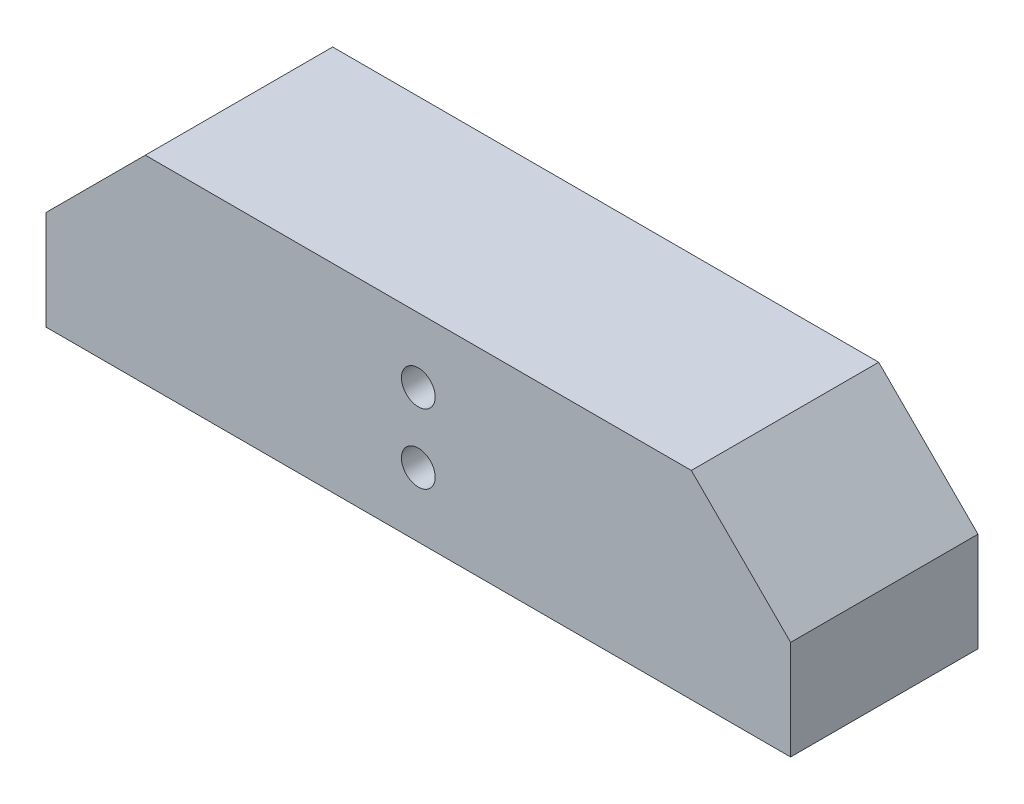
ISO-10303-21;
HEADER;
FILE_DESCRIPTION(('STEP AP214'),'2;1');
FILE_NAME('part.step','',(''),(''),'','','');
FILE_SCHEMA(('AUTOMOTIVE_DESIGN { 1 0 10303 214 1 1 1 1 }'));
ENDSEC;
DATA;
#1=APPLICATION_CONTEXT('core data for automotive mechanical design processes');
#2=APPLICATION_PROTOCOL_DEFINITION('international standard','automotive_design',2000,#1);
#3=PRODUCT_CONTEXT('',#1,'mechanical');
#4=PRODUCT('Part','Part','',(#3));
#5=PRODUCT_RELATED_PRODUCT_CATEGORY('part','',(#4));
#6=PRODUCT_DEFINITION_FORMATION('','',#4);
#7=PRODUCT_DEFINITION_CONTEXT('part definition',#1,'design');
#8=PRODUCT_DEFINITION('design','',#6,#7);
#9=PRODUCT_DEFINITION_SHAPE('','',#8);
#10=(LENGTH_UNIT() NAMED_UNIT(*) SI_UNIT(.MILLI.,.METRE.));
#11=(NAMED_UNIT(*) PLANE_ANGLE_UNIT() SI_UNIT($,.RADIAN.));
#12=(NAMED_UNIT(*) SI_UNIT($,.STERADIAN.) SOLID_ANGLE_UNIT());
#13=UNCERTAINTY_MEASURE_WITH_UNIT(LENGTH_MEASURE(1.E-05),#10,'distance_accuracy_value','');
#14=(GEOMETRIC_REPRESENTATION_CONTEXT(3) GLOBAL_UNCERTAINTY_ASSIGNED_CONTEXT((#13)) GLOBAL_UNIT_ASSIGNED_CONTEXT((#10,
#11,#12)) REPRESENTATION_CONTEXT('',''));
#15=CARTESIAN_POINT('',(0.,0.,0.));
#16=DIRECTION('',(0.,0.,1.));
#17=DIRECTION('',(1.,0.,0.));
#18=AXIS2_PLACEMENT_3D('',#15,#16,#17);
#19=CARTESIAN_POINT('',(75.,-20.,10.));
#20=DIRECTION('',(-1.,0.,0.));
#21=DIRECTION('',(0.,0.,1.));
#22=AXIS2_PLACEMENT_3D('',#19,#20,#21);
#23=PLANE('',#22);
#24=DIRECTION('',(0.,1.,0.));
#25=VECTOR('',#24,1.);
#26=CARTESIAN_POINT('',(75.,-20.,0.));
#27=LINE('',#26,#25);
#28=CARTESIAN_POINT('',(75.,-20.,0.));
#29=VERTEX_POINT('',#28);
#30=CARTESIAN_POINT('',(75.,0.,0.));
#31=VERTEX_POINT('',#30);
#32=EDGE_CURVE('E172',#29,#31,#27,.T.);
#33=ORIENTED_EDGE('',*,*,#32,.T.);
#34=DIRECTION('',(0.,0.,1.));
#35=VECTOR('',#34,1.);
#36=CARTESIAN_POINT('',(75.,0.,10.));
#37=LINE('',#36,#35);
#38=CARTESIAN_POINT('',(75.,0.,37.75));
#39=VERTEX_POINT('',#38);
#40=EDGE_CURVE('E56',#31,#39,#37,.T.);
#41=ORIENTED_EDGE('',*,*,#40,.T.);
#42=DIRECTION('',(0.,1.,0.));
#43=VECTOR('',#42,1.);
#44=CARTESIAN_POINT('',(75.,20.,37.75));
#45=LINE('',#44,#43);
#46=CARTESIAN_POINT('',(75.,-20.,37.75));
#47=VERTEX_POINT('',#46);
#48=EDGE_CURVE('E157',#47,#39,#45,.T.);
#49=ORIENTED_EDGE('',*,*,#48,.F.);
#50=DIRECTION('',(0.,0.,-1.));
#51=VECTOR('',#50,1.);
#52=CARTESIAN_POINT('',(75.,-20.,10.));
#53=LINE('',#52,#51);
#54=EDGE_CURVE('E153',#47,#29,#53,.T.);
#55=ORIENTED_EDGE('',*,*,#54,.T.);
#56=EDGE_LOOP('',(#33,#41,#49,#55));
#57=FACE_BOUND('',#56,.T.);
#58=ADVANCED_FACE('F33',(#57),#23,.F.);
#59=CARTESIAN_POINT('',(-75.,20.,10.));
#60=DIRECTION('',(0.,-1.,0.));
#61=DIRECTION('',(0.,0.,-1.));
#62=AXIS2_PLACEMENT_3D('',#59,#60,#61);
#63=PLANE('',#62);
#64=DIRECTION('',(-1.,0.,0.));
#65=VECTOR('',#64,1.);
#66=CARTESIAN_POINT('',(-75.,20.,37.75));
#67=LINE('',#66,#65);
#68=CARTESIAN_POINT('',(55.,20.,37.75));
#69=VERTEX_POINT('',#68);
#70=CARTESIAN_POINT('',(-54.9999999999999,20.,37.75));
#71=VERTEX_POINT('',#70);
#72=EDGE_CURVE('E159',#69,#71,#67,.T.);
#73=ORIENTED_EDGE('',*,*,#72,.F.);
#74=DIRECTION('',(0.,0.,-1.));
#75=VECTOR('',#74,1.);
#76=CARTESIAN_POINT('',(55.,20.,10.));
#77=LINE('',#76,#75);
#78=CARTESIAN_POINT('',(55.,20.,0.));
#79=VERTEX_POINT('',#78);
#80=EDGE_CURVE('E259',#69,#79,#77,.T.);
#81=ORIENTED_EDGE('',*,*,#80,.T.);
#82=DIRECTION('',(-1.,0.,0.));
#83=VECTOR('',#82,1.);
#84=CARTESIAN_POINT('',(-75.,20.,0.));
#85=LINE('',#84,#83);
#86=CARTESIAN_POINT('',(-54.9999999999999,20.,0.));
#87=VERTEX_POINT('',#86);
#88=EDGE_CURVE('E201',#79,#87,#85,.T.);
#89=ORIENTED_EDGE('',*,*,#88,.T.);
#90=DIRECTION('',(0.,0.,1.));
#91=VECTOR('',#90,1.);
#92=CARTESIAN_POINT('',(-54.9999999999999,20.,10.));
#93=LINE('',#92,#91);
#94=EDGE_CURVE('E257',#87,#71,#93,.T.);
#95=ORIENTED_EDGE('',*,*,#94,.T.);
#96=EDGE_LOOP('',(#73,#81,#89,#95));
#97=FACE_BOUND('',#96,.T.);
#98=ADVANCED_FACE('F272',(#97),#63,.F.);
#99=CARTESIAN_POINT('',(-75.,-20.,10.));
#100=DIRECTION('',(1.,0.,0.));
#101=DIRECTION('',(0.,0.,-1.));
#102=AXIS2_PLACEMENT_3D('',#99,#100,#101);
#103=PLANE('',#102);
#104=DIRECTION('',(0.,-1.,0.));
#105=VECTOR('',#104,1.);
#106=CARTESIAN_POINT('',(-75.,20.,37.75));
#107=LINE('',#106,#105);
#108=CARTESIAN_POINT('',(-75.,0.,37.75));
#109=VERTEX_POINT('',#108);
#110=CARTESIAN_POINT('',(-75.,-20.,37.75));
#111=VERTEX_POINT('',#110);
#112=EDGE_CURVE('E135',#109,#111,#107,.T.);
#113=ORIENTED_EDGE('',*,*,#112,.F.);
#114=DIRECTION('',(0.,0.,-1.));
#115=VECTOR('',#114,1.);
#116=CARTESIAN_POINT('',(-75.,0.,10.));
#117=LINE('',#116,#115);
#118=CARTESIAN_POINT('',(-75.,0.,0.));
#119=VERTEX_POINT('',#118);
#120=EDGE_CURVE('E11',#109,#119,#117,.T.);
#121=ORIENTED_EDGE('',*,*,#120,.T.);
#122=DIRECTION('',(0.,-1.,0.));
#123=VECTOR('',#122,1.);
#124=CARTESIAN_POINT('',(-75.,-20.,0.));
#125=LINE('',#124,#123);
#126=CARTESIAN_POINT('',(-75.,-20.,0.));
#127=VERTEX_POINT('',#126);
#128=EDGE_CURVE('E148',#119,#127,#125,.T.);
#129=ORIENTED_EDGE('',*,*,#128,.T.);
#130=DIRECTION('',(0.,0.,-1.));
#131=VECTOR('',#130,1.);
#132=CARTESIAN_POINT('',(-75.,-20.,10.));
#133=LINE('',#132,#131);
#134=EDGE_CURVE('E145',#111,#127,#133,.T.);
#135=ORIENTED_EDGE('',*,*,#134,.F.);
#136=EDGE_LOOP('',(#113,#121,#129,#135));
#137=FACE_BOUND('',#136,.T.);
#138=ADVANCED_FACE('F146',(#137),#103,.F.);
#139=CARTESIAN_POINT('',(-45.,-13.,10.));
#140=DIRECTION('',(0.,0.,-1.));
#141=DIRECTION('',(-1.,0.,0.));
#142=AXIS2_PLACEMENT_3D('',#139,#140,#141);
#143=CYLINDRICAL_SURFACE('',#142,15.);
#144=CARTESIAN_POINT('',(-45.,-13.,0.));
#145=DIRECTION('',(0.,0.,-1.));
#146=DIRECTION('',(1.,0.,0.));
#147=AXIS2_PLACEMENT_3D('',#144,#145,#146);
#148=CIRCLE('',#147,15.);
#149=CARTESIAN_POINT('',(-59.3365383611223,-17.4117647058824,0.));
#150=VERTEX_POINT('',#149);
#151=CARTESIAN_POINT('',(-30.6634616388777,-17.4117647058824,0.));
#152=VERTEX_POINT('',#151);
#153=EDGE_CURVE('E207',#150,#152,#148,.T.);
#154=ORIENTED_EDGE('',*,*,#153,.T.);
#155=DIRECTION('',(0.,0.,-1.));
#156=VECTOR('',#155,1.);
#157=CARTESIAN_POINT('',(-30.6634616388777,-17.4117647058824,10.));
#158=LINE('',#157,#156);
#159=CARTESIAN_POINT('',(-30.6634616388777,-17.4117647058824,10.));
#160=VERTEX_POINT('',#159);
#161=EDGE_CURVE('E253',#152,#160,#158,.F.);
#162=ORIENTED_EDGE('',*,*,#161,.T.);
#163=CARTESIAN_POINT('',(-45.,-13.,10.));
#164=DIRECTION('',(0.,0.,-1.));
#165=DIRECTION('',(1.,0.,0.));
#166=AXIS2_PLACEMENT_3D('',#163,#164,#165);
#167=CIRCLE('',#166,15.);
#168=CARTESIAN_POINT('',(-59.3365383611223,-17.4117647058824,10.));
#169=VERTEX_POINT('',#168);
#170=EDGE_CURVE('E193',#169,#160,#167,.T.);
#171=ORIENTED_EDGE('',*,*,#170,.F.);
#172=DIRECTION('',(0.,0.,-1.));
#173=VECTOR('',#172,1.);
#174=CARTESIAN_POINT('',(-59.3365383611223,-17.4117647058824,10.));
#175=LINE('',#174,#173);
#176=EDGE_CURVE('E250',#169,#150,#175,.T.);
#177=ORIENTED_EDGE('',*,*,#176,.T.);
#178=EDGE_LOOP('',(#154,#162,#171,#177));
#179=FACE_BOUND('',#178,.T.);
#180=ADVANCED_FACE('F357',(#179),#143,.F.);
#181=CARTESIAN_POINT('',(45.,-13.,10.));
#182=DIRECTION('',(0.,0.,-1.));
#183=DIRECTION('',(-1.,0.,0.));
#184=AXIS2_PLACEMENT_3D('',#181,#182,#183);
#185=CYLINDRICAL_SURFACE('',#184,15.);
#186=CARTESIAN_POINT('',(45.,-13.,10.));
#187=DIRECTION('',(0.,0.,-1.));
#188=DIRECTION('',(1.,0.,0.));
#189=AXIS2_PLACEMENT_3D('',#186,#187,#188);
#190=CIRCLE('',#189,15.);
#191=CARTESIAN_POINT('',(30.6634616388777,-17.4117647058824,10.));
#192=VERTEX_POINT('',#191);
#193=CARTESIAN_POINT('',(59.3365383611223,-17.4117647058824,10.));
#194=VERTEX_POINT('',#193);
#195=EDGE_CURVE('E196',#192,#194,#190,.T.);
#196=ORIENTED_EDGE('',*,*,#195,.F.);
#197=DIRECTION('',(0.,0.,-1.));
#198=VECTOR('',#197,1.);
#199=CARTESIAN_POINT('',(30.6634616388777,-17.4117647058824,10.));
#200=LINE('',#199,#198);
#201=CARTESIAN_POINT('',(30.6634616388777,-17.4117647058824,0.));
#202=VERTEX_POINT('',#201);
#203=EDGE_CURVE('E219',#192,#202,#200,.T.);
#204=ORIENTED_EDGE('',*,*,#203,.T.);
#205=CARTESIAN_POINT('',(45.,-13.,0.));
#206=DIRECTION('',(0.,0.,-1.));
#207=DIRECTION('',(1.,0.,0.));
#208=AXIS2_PLACEMENT_3D('',#205,#206,#207);
#209=CIRCLE('',#208,15.);
#210=CARTESIAN_POINT('',(59.3365383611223,-17.4117647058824,0.));
#211=VERTEX_POINT('',#210);
#212=EDGE_CURVE('E213',#202,#211,#209,.T.);
#213=ORIENTED_EDGE('',*,*,#212,.T.);
#214=DIRECTION('',(0.,0.,-1.));
#215=VECTOR('',#214,1.);
#216=CARTESIAN_POINT('',(59.3365383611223,-17.4117647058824,10.));
#217=LINE('',#216,#215);
#218=EDGE_CURVE('E152',#211,#194,#217,.F.);
#219=ORIENTED_EDGE('',*,*,#218,.T.);
#220=EDGE_LOOP('',(#196,#204,#213,#219));
#221=FACE_BOUND('',#220,.T.);
#222=ADVANCED_FACE('F352',(#221),#185,.F.);
#223=CARTESIAN_POINT('',(58.2664991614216,-20.,10.));
#224=DIRECTION('',(0.,1.,0.));
#225=DIRECTION('',(0.,0.,1.));
#226=AXIS2_PLACEMENT_3D('',#223,#224,#225);
#227=PLANE('',#226);
#228=ORIENTED_EDGE('',*,*,#54,.F.);
#229=DIRECTION('',(1.,0.,0.));
#230=VECTOR('',#229,1.);
#231=CARTESIAN_POINT('',(-75.,-20.,37.75));
#232=LINE('',#231,#230);
#233=EDGE_CURVE('E139',#111,#47,#232,.T.);
#234=ORIENTED_EDGE('',*,*,#233,.F.);
#235=ORIENTED_EDGE('',*,*,#134,.T.);
#236=DIRECTION('',(1.,0.,0.));
#237=VECTOR('',#236,1.);
#238=CARTESIAN_POINT('',(-75.,-20.,0.));
#239=LINE('',#238,#237);
#240=CARTESIAN_POINT('',(-61.2480768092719,-20.,0.));
#241=VERTEX_POINT('',#240);
#242=EDGE_CURVE('E205',#127,#241,#239,.T.);
#243=ORIENTED_EDGE('',*,*,#242,.T.);
#244=DIRECTION('',(0.,0.,-1.));
#245=VECTOR('',#244,1.);
#246=CARTESIAN_POINT('',(-61.2480768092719,-20.,10.));
#247=LINE('',#246,#245);
#248=CARTESIAN_POINT('',(-61.2480768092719,-20.,10.));
#249=VERTEX_POINT('',#248);
#250=EDGE_CURVE('E255',#241,#249,#247,.F.);
#251=ORIENTED_EDGE('',*,*,#250,.T.);
#252=DIRECTION('',(1.,0.,0.));
#253=VECTOR('',#252,1.);
#254=CARTESIAN_POINT('',(-75.,-20.,10.));
#255=LINE('',#254,#253);
#256=CARTESIAN_POINT('',(-28.7519231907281,-20.,10.));
#257=VERTEX_POINT('',#256);
#258=EDGE_CURVE('E142',#249,#257,#255,.T.);
#259=ORIENTED_EDGE('',*,*,#258,.T.);
#260=DIRECTION('',(0.,0.,-1.));
#261=VECTOR('',#260,1.);
#262=CARTESIAN_POINT('',(-28.7519231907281,-20.,10.));
#263=LINE('',#262,#261);
#264=CARTESIAN_POINT('',(-28.7519231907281,-20.,0.));
#265=VERTEX_POINT('',#264);
#266=EDGE_CURVE('E230',#257,#265,#263,.T.);
#267=ORIENTED_EDGE('',*,*,#266,.T.);
#268=DIRECTION('',(1.,0.,0.));
#269=VECTOR('',#268,1.);
#270=CARTESIAN_POINT('',(-31.7335008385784,-20.,0.));
#271=LINE('',#270,#269);
#272=CARTESIAN_POINT('',(28.7519231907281,-20.,0.));
#273=VERTEX_POINT('',#272);
#274=EDGE_CURVE('E210',#265,#273,#271,.T.);
#275=ORIENTED_EDGE('',*,*,#274,.T.);
#276=DIRECTION('',(0.,0.,-1.));
#277=VECTOR('',#276,1.);
#278=CARTESIAN_POINT('',(28.7519231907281,-20.,10.));
#279=LINE('',#278,#277);
#280=CARTESIAN_POINT('',(28.7519231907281,-20.,10.));
#281=VERTEX_POINT('',#280);
#282=EDGE_CURVE('E233',#273,#281,#279,.F.);
#283=ORIENTED_EDGE('',*,*,#282,.T.);
#284=CARTESIAN_POINT('',(61.2480768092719,-20.,10.));
#285=VERTEX_POINT('',#284);
#286=EDGE_CURVE('E165',#281,#285,#255,.T.);
#287=ORIENTED_EDGE('',*,*,#286,.T.);
#288=DIRECTION('',(0.,0.,-1.));
#289=VECTOR('',#288,1.);
#290=CARTESIAN_POINT('',(61.2480768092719,-20.,10.));
#291=LINE('',#290,#289);
#292=CARTESIAN_POINT('',(61.2480768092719,-20.,0.));
#293=VERTEX_POINT('',#292);
#294=EDGE_CURVE('E247',#285,#293,#291,.T.);
#295=ORIENTED_EDGE('',*,*,#294,.T.);
#296=DIRECTION('',(1.,0.,0.));
#297=VECTOR('',#296,1.);
#298=CARTESIAN_POINT('',(58.2664991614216,-20.,0.));
#299=LINE('',#298,#297);
#300=EDGE_CURVE('E197',#293,#29,#299,.T.);
#301=ORIENTED_EDGE('',*,*,#300,.T.);
#302=EDGE_LOOP('',(#228,#234,#235,#243,#251,#259,#267,#275,#283,#287,#295,#301));
#303=FACE_BOUND('',#302,.T.);
#304=ADVANCED_FACE('F155',(#303),#227,.F.);
#305=CARTESIAN_POINT('',(-45.,-13.,0.));
#306=DIRECTION('',(0.,0.,1.));
#307=DIRECTION('',(1.,0.,0.));
#308=AXIS2_PLACEMENT_3D('',#305,#306,#307);
#309=PLANE('',#308);
#310=CARTESIAN_POINT('',(-66.9,-17.,0.));
#311=DIRECTION('',(0.,0.,1.));
#312=DIRECTION('',(1.,0.,0.));
#313=AXIS2_PLACEMENT_3D('',#310,#311,#312);
#314=CIRCLE('',#313,0.999999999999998);
#315=CARTESIAN_POINT('',(-65.9,-17.,0.));
#316=VERTEX_POINT('',#315);
#317=EDGE_CURVE('E169',#316,#316,#314,.T.);
#318=ORIENTED_EDGE('',*,*,#317,.T.);
#319=EDGE_LOOP('',(#318));
#320=FACE_BOUND('',#319,.T.);
#321=CARTESIAN_POINT('',(23.1,-17.,0.));
#322=DIRECTION('',(0.,0.,1.));
#323=DIRECTION('',(1.,0.,0.));
#324=AXIS2_PLACEMENT_3D('',#321,#322,#323);
#325=CIRCLE('',#324,1.);
#326=CARTESIAN_POINT('',(24.1,-17.,0.));
#327=VERTEX_POINT('',#326);
#328=EDGE_CURVE('E173',#327,#327,#325,.T.);
#329=ORIENTED_EDGE('',*,*,#328,.T.);
#330=EDGE_LOOP('',(#329));
#331=FACE_BOUND('',#330,.T.);
#332=CARTESIAN_POINT('',(-23.1,-17.,0.));
#333=DIRECTION('',(0.,0.,1.));
#334=DIRECTION('',(1.,0.,0.));
#335=AXIS2_PLACEMENT_3D('',#332,#333,#334);
#336=CIRCLE('',#335,1.);
#337=CARTESIAN_POINT('',(-22.1,-17.,0.));
#338=VERTEX_POINT('',#337);
#339=EDGE_CURVE('E181',#338,#338,#336,.T.);
#340=ORIENTED_EDGE('',*,*,#339,.T.);
#341=EDGE_LOOP('',(#340));
#342=FACE_BOUND('',#341,.T.);
#343=CARTESIAN_POINT('',(66.9,-17.,0.));
#344=DIRECTION('',(0.,0.,1.));
#345=DIRECTION('',(1.,0.,0.));
#346=AXIS2_PLACEMENT_3D('',#343,#344,#345);
#347=CIRCLE('',#346,0.999999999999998);
#348=CARTESIAN_POINT('',(67.9,-17.,0.));
#349=VERTEX_POINT('',#348);
#350=EDGE_CURVE('E177',#349,#349,#347,.T.);
#351=ORIENTED_EDGE('',*,*,#350,.T.);
#352=EDGE_LOOP('',(#351));
#353=FACE_BOUND('',#352,.T.);
#354=ORIENTED_EDGE('',*,*,#88,.F.);
#355=DIRECTION('',(-0.707106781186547,0.707106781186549,0.));
#356=VECTOR('',#355,1.);
#357=CARTESIAN_POINT('',(55.,20.,0.));
#358=LINE('',#357,#356);
#359=EDGE_CURVE('E264',#79,#31,#358,.F.);
#360=ORIENTED_EDGE('',*,*,#359,.T.);
#361=ORIENTED_EDGE('',*,*,#32,.F.);
#362=ORIENTED_EDGE('',*,*,#300,.F.);
#363=CARTESIAN_POINT('',(61.2480768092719,-18.,0.));
#364=DIRECTION('',(0.,0.,1.));
#365=DIRECTION('',(1.,0.,0.));
#366=AXIS2_PLACEMENT_3D('',#363,#364,#365);
#367=CIRCLE('',#366,2.);
#368=EDGE_CURVE('E226',#293,#211,#367,.F.);
#369=ORIENTED_EDGE('',*,*,#368,.T.);
#370=ORIENTED_EDGE('',*,*,#212,.F.);
#371=CARTESIAN_POINT('',(28.7519231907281,-18.,0.));
#372=DIRECTION('',(0.,0.,1.));
#373=DIRECTION('',(1.,0.,0.));
#374=AXIS2_PLACEMENT_3D('',#371,#372,#373);
#375=CIRCLE('',#374,2.);
#376=EDGE_CURVE('E228',#202,#273,#375,.F.);
#377=ORIENTED_EDGE('',*,*,#376,.T.);
#378=ORIENTED_EDGE('',*,*,#274,.F.);
#379=CARTESIAN_POINT('',(-28.7519231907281,-18.,0.));
#380=DIRECTION('',(0.,0.,1.));
#381=DIRECTION('',(1.,0.,0.));
#382=AXIS2_PLACEMENT_3D('',#379,#380,#381);
#383=CIRCLE('',#382,2.);
#384=EDGE_CURVE('E224',#265,#152,#383,.F.);
#385=ORIENTED_EDGE('',*,*,#384,.T.);
#386=ORIENTED_EDGE('',*,*,#153,.F.);
#387=CARTESIAN_POINT('',(-61.2480768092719,-18.,0.));
#388=DIRECTION('',(0.,0.,1.));
#389=DIRECTION('',(1.,0.,0.));
#390=AXIS2_PLACEMENT_3D('',#387,#388,#389);
#391=CIRCLE('',#390,2.);
#392=EDGE_CURVE('E222',#150,#241,#391,.F.);
#393=ORIENTED_EDGE('',*,*,#392,.T.);
#394=ORIENTED_EDGE('',*,*,#242,.F.);
#395=ORIENTED_EDGE('',*,*,#128,.F.);
#396=DIRECTION('',(-0.707106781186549,-0.707106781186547,0.));
#397=VECTOR('',#396,1.);
#398=CARTESIAN_POINT('',(-75.,0.,0.));
#399=LINE('',#398,#397);
#400=EDGE_CURVE('E262',#119,#87,#399,.F.);
#401=ORIENTED_EDGE('',*,*,#400,.T.);
#402=EDGE_LOOP('',(#354,#360,#361,#362,#369,#370,#377,#378,#385,#386,#393,#394,#395,#401));
#403=FACE_BOUND('',#402,.T.);
#404=ADVANCED_FACE('F278',(#320,#331,#342,#353,#403),#309,.F.);
#405=CARTESIAN_POINT('',(28.7519231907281,-18.,10.));
#406=DIRECTION('',(0.,0.,-1.));
#407=DIRECTION('',(-1.,0.,0.));
#408=AXIS2_PLACEMENT_3D('',#405,#406,#407);
#409=CYLINDRICAL_SURFACE('',#408,2.);
#410=CARTESIAN_POINT('',(28.7519231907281,-18.,10.));
#411=DIRECTION('',(0.,0.,1.));
#412=DIRECTION('',(1.,0.,0.));
#413=AXIS2_PLACEMENT_3D('',#410,#411,#412);
#414=CIRCLE('',#413,2.);
#415=EDGE_CURVE('E244',#281,#192,#414,.T.);
#416=ORIENTED_EDGE('',*,*,#415,.F.);
#417=ORIENTED_EDGE('',*,*,#282,.F.);
#418=ORIENTED_EDGE('',*,*,#376,.F.);
#419=ORIENTED_EDGE('',*,*,#203,.F.);
#420=EDGE_LOOP('',(#416,#417,#418,#419));
#421=FACE_BOUND('',#420,.T.);
#422=ADVANCED_FACE('F288',(#421),#409,.T.);
#423=CARTESIAN_POINT('',(61.2480768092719,-18.,10.));
#424=DIRECTION('',(0.,0.,-1.));
#425=DIRECTION('',(-1.,0.,0.));
#426=AXIS2_PLACEMENT_3D('',#423,#424,#425);
#427=CYLINDRICAL_SURFACE('',#426,2.);
#428=CARTESIAN_POINT('',(61.2480768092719,-18.,10.));
#429=DIRECTION('',(0.,0.,1.));
#430=DIRECTION('',(1.,0.,0.));
#431=AXIS2_PLACEMENT_3D('',#428,#429,#430);
#432=CIRCLE('',#431,2.);
#433=EDGE_CURVE('E241',#194,#285,#432,.T.);
#434=ORIENTED_EDGE('',*,*,#433,.F.);
#435=ORIENTED_EDGE('',*,*,#218,.F.);
#436=ORIENTED_EDGE('',*,*,#368,.F.);
#437=ORIENTED_EDGE('',*,*,#294,.F.);
#438=EDGE_LOOP('',(#434,#435,#436,#437));
#439=FACE_BOUND('',#438,.T.);
#440=ADVANCED_FACE('F291',(#439),#427,.T.);
#441=CARTESIAN_POINT('',(-28.7519231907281,-18.,10.));
#442=DIRECTION('',(0.,0.,-1.));
#443=DIRECTION('',(-1.,0.,0.));
#444=AXIS2_PLACEMENT_3D('',#441,#442,#443);
#445=CYLINDRICAL_SURFACE('',#444,2.);
#446=CARTESIAN_POINT('',(-28.7519231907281,-18.,10.));
#447=DIRECTION('',(0.,0.,1.));
#448=DIRECTION('',(1.,0.,0.));
#449=AXIS2_PLACEMENT_3D('',#446,#447,#448);
#450=CIRCLE('',#449,2.);
#451=EDGE_CURVE('E238',#160,#257,#450,.T.);
#452=ORIENTED_EDGE('',*,*,#451,.F.);
#453=ORIENTED_EDGE('',*,*,#161,.F.);
#454=ORIENTED_EDGE('',*,*,#384,.F.);
#455=ORIENTED_EDGE('',*,*,#266,.F.);
#456=EDGE_LOOP('',(#452,#453,#454,#455));
#457=FACE_BOUND('',#456,.T.);
#458=ADVANCED_FACE('F295',(#457),#445,.T.);
#459=CARTESIAN_POINT('',(-61.2480768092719,-18.,10.));
#460=DIRECTION('',(0.,0.,-1.));
#461=DIRECTION('',(-1.,0.,0.));
#462=AXIS2_PLACEMENT_3D('',#459,#460,#461);
#463=CYLINDRICAL_SURFACE('',#462,2.);
#464=CARTESIAN_POINT('',(-61.2480768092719,-18.,10.));
#465=DIRECTION('',(0.,0.,1.));
#466=DIRECTION('',(1.,0.,0.));
#467=AXIS2_PLACEMENT_3D('',#464,#465,#466);
#468=CIRCLE('',#467,2.);
#469=EDGE_CURVE('E235',#249,#169,#468,.T.);
#470=ORIENTED_EDGE('',*,*,#469,.F.);
#471=ORIENTED_EDGE('',*,*,#250,.F.);
#472=ORIENTED_EDGE('',*,*,#392,.F.);
#473=ORIENTED_EDGE('',*,*,#176,.F.);
#474=EDGE_LOOP('',(#470,#471,#472,#473));
#475=FACE_BOUND('',#474,.T.);
#476=ADVANCED_FACE('F299',(#475),#463,.T.);
#477=CARTESIAN_POINT('',(66.9,-17.,0.));
#478=DIRECTION('',(0.,0.,1.));
#479=DIRECTION('',(1.,0.,0.));
#480=AXIS2_PLACEMENT_3D('',#477,#478,#479);
#481=CYLINDRICAL_SURFACE('',#480,0.999999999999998);
#482=ORIENTED_EDGE('',*,*,#350,.F.);
#483=EDGE_LOOP('',(#482));
#484=FACE_BOUND('',#483,.T.);
#485=CARTESIAN_POINT('',(66.9,-17.,10.));
#486=DIRECTION('',(0.,0.,1.));
#487=DIRECTION('',(1.,0.,0.));
#488=AXIS2_PLACEMENT_3D('',#485,#486,#487);
#489=CIRCLE('',#488,0.999999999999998);
#490=CARTESIAN_POINT('',(67.9,-17.,10.));
#491=VERTEX_POINT('',#490);
#492=EDGE_CURVE('E164',#491,#491,#489,.T.);
#493=ORIENTED_EDGE('',*,*,#492,.T.);
#494=EDGE_LOOP('',(#493));
#495=FACE_BOUND('',#494,.T.);
#496=ADVANCED_FACE('F302',(#484,#495),#481,.F.);
#497=CARTESIAN_POINT('',(-23.1,-17.,0.));
#498=DIRECTION('',(0.,0.,1.));
#499=DIRECTION('',(1.,0.,0.));
#500=AXIS2_PLACEMENT_3D('',#497,#498,#499);
#501=CYLINDRICAL_SURFACE('',#500,1.);
#502=ORIENTED_EDGE('',*,*,#339,.F.);
#503=EDGE_LOOP('',(#502));
#504=FACE_BOUND('',#503,.T.);
#505=CARTESIAN_POINT('',(-23.1,-17.,10.));
#506=DIRECTION('',(0.,0.,1.));
#507=DIRECTION('',(1.,0.,0.));
#508=AXIS2_PLACEMENT_3D('',#505,#506,#507);
#509=CIRCLE('',#508,1.);
#510=CARTESIAN_POINT('',(-22.1,-17.,10.));
#511=VERTEX_POINT('',#510);
#512=EDGE_CURVE('E184',#511,#511,#509,.T.);
#513=ORIENTED_EDGE('',*,*,#512,.T.);
#514=EDGE_LOOP('',(#513));
#515=FACE_BOUND('',#514,.T.);
#516=ADVANCED_FACE('F378',(#504,#515),#501,.F.);
#517=CARTESIAN_POINT('',(23.1,-17.,0.));
#518=DIRECTION('',(0.,0.,1.));
#519=DIRECTION('',(1.,0.,0.));
#520=AXIS2_PLACEMENT_3D('',#517,#518,#519);
#521=CYLINDRICAL_SURFACE('',#520,1.);
#522=ORIENTED_EDGE('',*,*,#328,.F.);
#523=EDGE_LOOP('',(#522));
#524=FACE_BOUND('',#523,.T.);
#525=CARTESIAN_POINT('',(23.1,-17.,10.));
#526=DIRECTION('',(0.,0.,1.));
#527=DIRECTION('',(1.,0.,0.));
#528=AXIS2_PLACEMENT_3D('',#525,#526,#527);
#529=CIRCLE('',#528,1.);
#530=CARTESIAN_POINT('',(24.1,-17.,10.));
#531=VERTEX_POINT('',#530);
#532=EDGE_CURVE('E178',#531,#531,#529,.T.);
#533=ORIENTED_EDGE('',*,*,#532,.T.);
#534=EDGE_LOOP('',(#533));
#535=FACE_BOUND('',#534,.T.);
#536=ADVANCED_FACE('F334',(#524,#535),#521,.F.);
#537=CARTESIAN_POINT('',(-66.9,-17.,0.));
#538=DIRECTION('',(0.,0.,1.));
#539=DIRECTION('',(1.,0.,0.));
#540=AXIS2_PLACEMENT_3D('',#537,#538,#539);
#541=CYLINDRICAL_SURFACE('',#540,0.999999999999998);
#542=ORIENTED_EDGE('',*,*,#317,.F.);
#543=EDGE_LOOP('',(#542));
#544=FACE_BOUND('',#543,.T.);
#545=CARTESIAN_POINT('',(-66.9,-17.,10.));
#546=DIRECTION('',(0.,0.,1.));
#547=DIRECTION('',(1.,0.,0.));
#548=AXIS2_PLACEMENT_3D('',#545,#546,#547);
#549=CIRCLE('',#548,0.999999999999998);
#550=CARTESIAN_POINT('',(-65.9,-17.,10.));
#551=VERTEX_POINT('',#550);
#552=EDGE_CURVE('E174',#551,#551,#549,.T.);
#553=ORIENTED_EDGE('',*,*,#552,.T.);
#554=EDGE_LOOP('',(#553));
#555=FACE_BOUND('',#554,.T.);
#556=ADVANCED_FACE('F325',(#544,#555),#541,.F.);
#557=CARTESIAN_POINT('',(0.,0.,10.));
#558=DIRECTION('',(0.,0.,1.));
#559=DIRECTION('',(1.,0.,0.));
#560=AXIS2_PLACEMENT_3D('',#557,#558,#559);
#561=PLANE('',#560);
#562=ORIENTED_EDGE('',*,*,#258,.F.);
#563=ORIENTED_EDGE('',*,*,#469,.T.);
#564=ORIENTED_EDGE('',*,*,#170,.T.);
#565=ORIENTED_EDGE('',*,*,#451,.T.);
#566=EDGE_LOOP('',(#562,#563,#564,#565));
#567=FACE_BOUND('',#566,.T.);
#568=ADVANCED_FACE('F315',(#567),#561,.F.);
#569=CARTESIAN_POINT('',(0.,0.,37.75));
#570=DIRECTION('',(0.,0.,1.));
#571=DIRECTION('',(1.,0.,0.));
#572=AXIS2_PLACEMENT_3D('',#569,#570,#571);
#573=PLANE('',#572);
#574=CARTESIAN_POINT('',(0.,7.,37.75));
#575=DIRECTION('',(0.,0.,1.));
#576=DIRECTION('',(1.,0.,0.));
#577=AXIS2_PLACEMENT_3D('',#574,#575,#576);
#578=CIRCLE('',#577,3.4);
#579=CARTESIAN_POINT('',(3.4,7.,37.75));
#580=VERTEX_POINT('',#579);
#581=EDGE_CURVE('E500',#580,#580,#578,.T.);
#582=ORIENTED_EDGE('',*,*,#581,.F.);
#583=EDGE_LOOP('',(#582));
#584=FACE_BOUND('',#583,.T.);
#585=CARTESIAN_POINT('',(0.,-7.,37.75));
#586=DIRECTION('',(0.,0.,1.));
#587=DIRECTION('',(1.,0.,0.));
#588=AXIS2_PLACEMENT_3D('',#585,#586,#587);
#589=CIRCLE('',#588,3.4);
#590=CARTESIAN_POINT('',(3.4,-7.,37.75));
#591=VERTEX_POINT('',#590);
#592=EDGE_CURVE('E507',#591,#591,#589,.T.);
#593=ORIENTED_EDGE('',*,*,#592,.F.);
#594=EDGE_LOOP('',(#593));
#595=FACE_BOUND('',#594,.T.);
#596=ORIENTED_EDGE('',*,*,#48,.T.);
#597=DIRECTION('',(0.707106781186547,-0.707106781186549,0.));
#598=VECTOR('',#597,1.);
#599=CARTESIAN_POINT('',(37.5000000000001,37.5,37.75));
#600=LINE('',#599,#598);
#601=EDGE_CURVE('E41',#39,#69,#600,.F.);
#602=ORIENTED_EDGE('',*,*,#601,.T.);
#603=ORIENTED_EDGE('',*,*,#72,.T.);
#604=DIRECTION('',(0.707106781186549,0.707106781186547,0.));
#605=VECTOR('',#604,1.);
#606=CARTESIAN_POINT('',(-37.4999999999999,37.5,37.75));
#607=LINE('',#606,#605);
#608=EDGE_CURVE('E48',#71,#109,#607,.F.);
#609=ORIENTED_EDGE('',*,*,#608,.T.);
#610=ORIENTED_EDGE('',*,*,#112,.T.);
#611=ORIENTED_EDGE('',*,*,#233,.T.);
#612=EDGE_LOOP('',(#596,#602,#603,#609,#610,#611));
#613=FACE_BOUND('',#612,.T.);
#614=ADVANCED_FACE('F137',(#584,#595,#613),#573,.T.);
#615=ORIENTED_EDGE('',*,*,#286,.F.);
#616=ORIENTED_EDGE('',*,*,#415,.T.);
#617=ORIENTED_EDGE('',*,*,#195,.T.);
#618=ORIENTED_EDGE('',*,*,#433,.T.);
#619=EDGE_LOOP('',(#615,#616,#617,#618));
#620=FACE_BOUND('',#619,.T.);
#621=ADVANCED_FACE('F327',(#620),#561,.F.);
#622=ORIENTED_EDGE('',*,*,#492,.F.);
#623=EDGE_LOOP('',(#622));
#624=FACE_BOUND('',#623,.T.);
#625=ADVANCED_FACE('F338',(#624),#561,.F.);
#626=ORIENTED_EDGE('',*,*,#512,.F.);
#627=EDGE_LOOP('',(#626));
#628=FACE_BOUND('',#627,.T.);
#629=ADVANCED_FACE('F319',(#628),#561,.F.);
#630=ORIENTED_EDGE('',*,*,#532,.F.);
#631=EDGE_LOOP('',(#630));
#632=FACE_BOUND('',#631,.T.);
#633=ADVANCED_FACE('F312',(#632),#561,.F.);
#634=ORIENTED_EDGE('',*,*,#552,.F.);
#635=EDGE_LOOP('',(#634));
#636=FACE_BOUND('',#635,.T.);
#637=ADVANCED_FACE('F305',(#636),#561,.F.);
#638=CARTESIAN_POINT('',(55.,20.,10.));
#639=DIRECTION('',(-0.707106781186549,-0.707106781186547,0.));
#640=DIRECTION('',(0.,0.,-1.));
#641=AXIS2_PLACEMENT_3D('',#638,#639,#640);
#642=PLANE('',#641);
#643=ORIENTED_EDGE('',*,*,#601,.F.);
#644=ORIENTED_EDGE('',*,*,#40,.F.);
#645=ORIENTED_EDGE('',*,*,#359,.F.);
#646=ORIENTED_EDGE('',*,*,#80,.F.);
#647=EDGE_LOOP('',(#643,#644,#645,#646));
#648=FACE_BOUND('',#647,.T.);
#649=ADVANCED_FACE('F275',(#648),#642,.F.);
#650=CARTESIAN_POINT('',(-75.,0.,10.));
#651=DIRECTION('',(0.707106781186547,-0.707106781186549,0.));
#652=DIRECTION('',(0.,0.,-1.));
#653=AXIS2_PLACEMENT_3D('',#650,#651,#652);
#654=PLANE('',#653);
#655=ORIENTED_EDGE('',*,*,#608,.F.);
#656=ORIENTED_EDGE('',*,*,#94,.F.);
#657=ORIENTED_EDGE('',*,*,#400,.F.);
#658=ORIENTED_EDGE('',*,*,#120,.F.);
#659=EDGE_LOOP('',(#655,#656,#657,#658));
#660=FACE_BOUND('',#659,.T.);
#661=ADVANCED_FACE('F35',(#660),#654,.F.);
#662=CARTESIAN_POINT('',(0.,-7.,17.75));
#663=DIRECTION('',(0.,0.,1.));
#664=DIRECTION('',(1.,0.,0.));
#665=AXIS2_PLACEMENT_3D('',#662,#663,#664);
#666=CYLINDRICAL_SURFACE('',#665,3.4);
#667=CARTESIAN_POINT('',(0.,-7.,17.75));
#668=DIRECTION('',(0.,0.,1.));
#669=DIRECTION('',(1.,0.,0.));
#670=AXIS2_PLACEMENT_3D('',#667,#668,#669);
#671=CIRCLE('',#670,3.4);
#672=CARTESIAN_POINT('',(3.4,-7.,17.75));
#673=VERTEX_POINT('',#672);
#674=EDGE_CURVE('E503',#673,#673,#671,.T.);
#675=ORIENTED_EDGE('',*,*,#674,.F.);
#676=EDGE_LOOP('',(#675));
#677=FACE_BOUND('',#676,.T.);
#678=ORIENTED_EDGE('',*,*,#592,.T.);
#679=EDGE_LOOP('',(#678));
#680=FACE_BOUND('',#679,.T.);
#681=ADVANCED_FACE('F310',(#677,#680),#666,.F.);
#682=CARTESIAN_POINT('',(0.,-7.,17.75));
#683=DIRECTION('',(0.,0.,1.));
#684=DIRECTION('',(1.,0.,0.));
#685=AXIS2_PLACEMENT_3D('',#682,#683,#684);
#686=PLANE('',#685);
#687=ORIENTED_EDGE('',*,*,#674,.T.);
#688=EDGE_LOOP('',(#687));
#689=FACE_BOUND('',#688,.T.);
#690=ADVANCED_FACE('F464',(#689),#686,.T.);
#691=CARTESIAN_POINT('',(0.,7.,17.75));
#692=DIRECTION('',(0.,0.,1.));
#693=DIRECTION('',(1.,0.,0.));
#694=AXIS2_PLACEMENT_3D('',#691,#692,#693);
#695=CYLINDRICAL_SURFACE('',#694,3.4);
#696=CARTESIAN_POINT('',(0.,7.,17.75));
#697=DIRECTION('',(0.,0.,1.));
#698=DIRECTION('',(1.,0.,0.));
#699=AXIS2_PLACEMENT_3D('',#696,#697,#698);
#700=CIRCLE('',#699,3.4);
#701=CARTESIAN_POINT('',(3.4,7.,17.75));
#702=VERTEX_POINT('',#701);
#703=EDGE_CURVE('E168',#702,#702,#700,.T.);
#704=ORIENTED_EDGE('',*,*,#703,.F.);
#705=EDGE_LOOP('',(#704));
#706=FACE_BOUND('',#705,.T.);
#707=ORIENTED_EDGE('',*,*,#581,.T.);
#708=EDGE_LOOP('',(#707));
#709=FACE_BOUND('',#708,.T.);
#710=ADVANCED_FACE('F474',(#706,#709),#695,.F.);
#711=CARTESIAN_POINT('',(0.,7.,17.75));
#712=DIRECTION('',(0.,0.,1.));
#713=DIRECTION('',(1.,0.,0.));
#714=AXIS2_PLACEMENT_3D('',#711,#712,#713);
#715=PLANE('',#714);
#716=ORIENTED_EDGE('',*,*,#703,.T.);
#717=EDGE_LOOP('',(#716));
#718=FACE_BOUND('',#717,.T.);
#719=ADVANCED_FACE('F484',(#718),#715,.T.);
#720=CLOSED_SHELL('',(#58,#98,#138,#180,#222,#304,#404,#422,#440,#458,#476,#496,#516,#536,#556,
#568,#614,#621,#625,#629,#633,#637,#649,#661,#681,#690,#710,#719));
#721=MANIFOLD_SOLID_BREP('B2',#720);
#722=ADVANCED_BREP_SHAPE_REPRESENTATION('',(#18,#721),#14);
#723=SHAPE_DEFINITION_REPRESENTATION(#9,#722);
ENDSEC;
END-ISO-10303-21;
